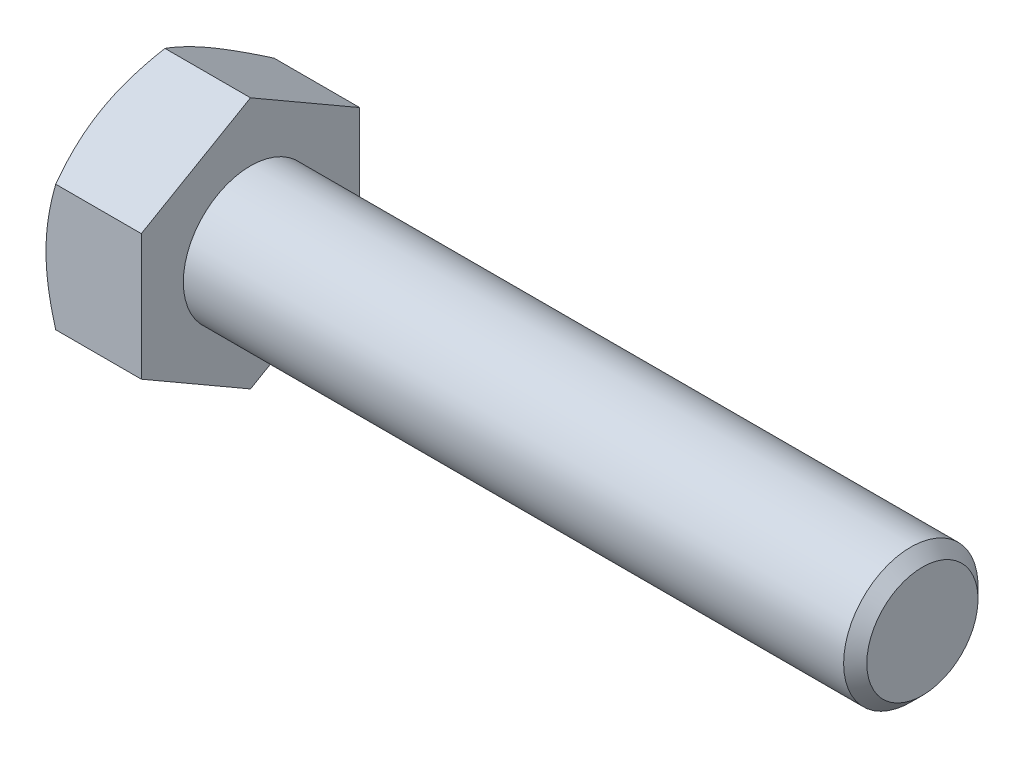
ISO-10303-21;
HEADER;
FILE_DESCRIPTION(('STEP AP214'),'2;1');
FILE_NAME('part.step','',(''),(''),'','','');
FILE_SCHEMA(('AUTOMOTIVE_DESIGN { 1 0 10303 214 1 1 1 1 }'));
ENDSEC;
DATA;
#1=APPLICATION_CONTEXT('core data for automotive mechanical design processes');
#2=APPLICATION_PROTOCOL_DEFINITION('international standard','automotive_design',2000,#1);
#3=PRODUCT_CONTEXT('',#1,'mechanical');
#4=PRODUCT('Part','Part','',(#3));
#5=PRODUCT_RELATED_PRODUCT_CATEGORY('part','',(#4));
#6=PRODUCT_DEFINITION_FORMATION('','',#4);
#7=PRODUCT_DEFINITION_CONTEXT('part definition',#1,'design');
#8=PRODUCT_DEFINITION('design','',#6,#7);
#9=PRODUCT_DEFINITION_SHAPE('','',#8);
#10=(LENGTH_UNIT() NAMED_UNIT(*) SI_UNIT(.MILLI.,.METRE.));
#11=(NAMED_UNIT(*) PLANE_ANGLE_UNIT() SI_UNIT($,.RADIAN.));
#12=(NAMED_UNIT(*) SI_UNIT($,.STERADIAN.) SOLID_ANGLE_UNIT());
#13=UNCERTAINTY_MEASURE_WITH_UNIT(LENGTH_MEASURE(1.E-05),#10,'distance_accuracy_value','');
#14=(GEOMETRIC_REPRESENTATION_CONTEXT(3) GLOBAL_UNCERTAINTY_ASSIGNED_CONTEXT((#13)) GLOBAL_UNIT_ASSIGNED_CONTEXT((#10,
#11,#12)) REPRESENTATION_CONTEXT('',''));
#15=CARTESIAN_POINT('',(0.,0.,0.));
#16=DIRECTION('',(0.,0.,1.));
#17=DIRECTION('',(1.,0.,0.));
#18=AXIS2_PLACEMENT_3D('',#15,#16,#17);
#19=CARTESIAN_POINT('',(5.675,3.75277674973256,-6.5));
#20=DIRECTION('',(0.,-0.866025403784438,0.500000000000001));
#21=DIRECTION('',(0.,-0.500000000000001,-0.866025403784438));
#22=AXIS2_PLACEMENT_3D('',#19,#20,#21);
#23=PLANE('',#22);
#24=CARTESIAN_POINT('',(0.580623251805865,7.50566896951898,0.0002));
#25=CARTESIAN_POINT('',(0.533004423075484,7.4231786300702,-0.14267745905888));
#26=CARTESIAN_POINT('',(0.487546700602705,7.34038072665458,-0.286087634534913));
#27=CARTESIAN_POINT('',(0.401548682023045,7.17411251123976,-0.574072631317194));
#28=CARTESIAN_POINT('',(0.361010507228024,7.09064192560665,-0.718647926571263));
#29=CARTESIAN_POINT('',(0.247571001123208,6.83889369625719,-1.15468865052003));
#30=CARTESIAN_POINT('',(0.183047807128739,6.66962231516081,-1.44787528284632));
#31=CARTESIAN_POINT('',(0.107386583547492,6.41631077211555,-1.88662374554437));
#32=CARTESIAN_POINT('',(0.0858328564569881,6.33302748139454,-2.03087463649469));
#33=CARTESIAN_POINT('',(0.0496903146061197,6.16608458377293,-2.32002821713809));
#34=CARTESIAN_POINT('',(0.0351008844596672,6.08242501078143,-2.46493084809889));
#35=CARTESIAN_POINT('',(0.0132587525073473,5.91496056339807,-2.75498777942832));
#36=CARTESIAN_POINT('',(0.00599772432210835,5.8311559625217,-2.90014160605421));
#37=CARTESIAN_POINT('',(-0.00103969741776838,5.66347396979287,-3.19057533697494));
#38=CARTESIAN_POINT('',(-0.000816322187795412,5.5795965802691,-3.33585523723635));
#39=CARTESIAN_POINT('',(0.0100834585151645,5.34979921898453,-3.73387594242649));
#40=CARTESIAN_POINT('',(0.0283818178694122,5.20395446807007,-3.98648646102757));
#41=CARTESIAN_POINT('',(0.0864063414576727,4.91323365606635,-4.49002967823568));
#42=CARTESIAN_POINT('',(0.126152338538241,4.76835861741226,-4.74096060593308));
#43=CARTESIAN_POINT('',(0.225505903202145,4.47705272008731,-5.24551722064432));
#44=CARTESIAN_POINT('',(0.285534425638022,4.33065861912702,-5.49907924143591));
#45=CARTESIAN_POINT('',(0.421774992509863,4.04005357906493,-6.00242193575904));
#46=CARTESIAN_POINT('',(0.497955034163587,3.89583891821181,-6.25220905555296));
#47=CARTESIAN_POINT('',(0.58062325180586,3.75266127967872,-6.5002));
#48=B_SPLINE_CURVE_WITH_KNOTS('',3,(#24,#25,#26,#27,#28,#29,#30,#31,#32,#33,#34,#35,#36,#37,#38,
#39,#40,#41,#42,#43,#44,#45,#46,#47),.UNSPECIFIED.,.F.,.F.,(4,2,2,2,2,2,2,2,2,2,2,4),(0.,
0.515105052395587,1.03043143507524,2.06322554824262,2.56697389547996,3.07067772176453,
3.57380860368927,4.0769239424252,4.9527935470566,5.82947446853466,6.72559912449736,
7.61996451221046),.UNSPECIFIED.);
#49=CARTESIAN_POINT('',(0.580556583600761,7.50555349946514,0.));
#50=VERTEX_POINT('',#49);
#51=CARTESIAN_POINT('',(0.,5.62916512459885,-3.25000000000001));
#52=VERTEX_POINT('',#51);
#53=EDGE_CURVE('E46',#50,#52,#48,.T.);
#54=ORIENTED_EDGE('',*,*,#53,.F.);
#55=DIRECTION('',(-1.,0.,0.));
#56=VECTOR('',#55,1.);
#57=CARTESIAN_POINT('',(5.675,7.50555349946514,0.));
#58=LINE('',#57,#56);
#59=CARTESIAN_POINT('',(5.675,7.50555349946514,0.));
#60=VERTEX_POINT('',#59);
#61=EDGE_CURVE('E142',#60,#50,#58,.T.);
#62=ORIENTED_EDGE('',*,*,#61,.F.);
#63=DIRECTION('',(0.,0.500000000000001,0.866025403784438));
#64=VECTOR('',#63,1.);
#65=CARTESIAN_POINT('',(5.675,3.75277674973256,-6.5));
#66=LINE('',#65,#64);
#67=CARTESIAN_POINT('',(5.675,3.75277674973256,-6.5));
#68=VERTEX_POINT('',#67);
#69=EDGE_CURVE('E227',#68,#60,#66,.T.);
#70=ORIENTED_EDGE('',*,*,#69,.F.);
#71=DIRECTION('',(-1.,0.,0.));
#72=VECTOR('',#71,1.);
#73=CARTESIAN_POINT('',(5.675,3.75277674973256,-6.5));
#74=LINE('',#73,#72);
#75=CARTESIAN_POINT('',(0.580556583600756,3.75277674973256,-6.5));
#76=VERTEX_POINT('',#75);
#77=EDGE_CURVE('E130',#68,#76,#74,.T.);
#78=ORIENTED_EDGE('',*,*,#77,.T.);
#79=EDGE_CURVE('E124',#52,#76,#48,.T.);
#80=ORIENTED_EDGE('',*,*,#79,.F.);
#81=EDGE_LOOP('',(#54,#62,#70,#78,#80));
#82=FACE_BOUND('',#81,.T.);
#83=ADVANCED_FACE('F30',(#82),#23,.F.);
#84=CARTESIAN_POINT('',(5.675,7.50555349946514,0.));
#85=DIRECTION('',(0.,-0.866025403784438,-0.500000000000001));
#86=DIRECTION('',(0.,0.500000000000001,-0.866025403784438));
#87=AXIS2_PLACEMENT_3D('',#84,#85,#86);
#88=PLANE('',#87);
#89=CARTESIAN_POINT('',(0.580623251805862,3.75266127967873,6.5002));
#90=CARTESIAN_POINT('',(0.53300442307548,3.8351516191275,6.35732254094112));
#91=CARTESIAN_POINT('',(0.487546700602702,3.91794952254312,6.21391236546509));
#92=CARTESIAN_POINT('',(0.401548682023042,4.08421773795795,5.9259273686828));
#93=CARTESIAN_POINT('',(0.361010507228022,4.16768832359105,5.78135207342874));
#94=CARTESIAN_POINT('',(0.247571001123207,4.41943655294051,5.34531134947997));
#95=CARTESIAN_POINT('',(0.183047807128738,4.58870793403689,5.05212471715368));
#96=CARTESIAN_POINT('',(0.107386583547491,4.84201947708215,4.61337625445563));
#97=CARTESIAN_POINT('',(0.0858328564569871,4.92530276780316,4.46912536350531));
#98=CARTESIAN_POINT('',(0.0496903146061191,5.09224566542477,4.17997178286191));
#99=CARTESIAN_POINT('',(0.0351008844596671,5.17590523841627,4.03506915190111));
#100=CARTESIAN_POINT('',(0.0132587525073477,5.34336968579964,3.74501222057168));
#101=CARTESIAN_POINT('',(0.00599772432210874,5.427174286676,3.59985839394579));
#102=CARTESIAN_POINT('',(-0.00103969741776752,5.59485627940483,3.30942466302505));
#103=CARTESIAN_POINT('',(-0.000816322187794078,5.6787336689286,3.16414476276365));
#104=CARTESIAN_POINT('',(0.0100834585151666,5.90853103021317,2.76612405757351));
#105=CARTESIAN_POINT('',(0.0283818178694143,6.05437578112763,2.51351353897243));
#106=CARTESIAN_POINT('',(0.0864063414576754,6.34509659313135,2.00997032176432));
#107=CARTESIAN_POINT('',(0.126152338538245,6.48997163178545,1.75903939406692));
#108=CARTESIAN_POINT('',(0.225505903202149,6.78127752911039,1.25448277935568));
#109=CARTESIAN_POINT('',(0.285534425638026,6.92767163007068,1.00092075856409));
#110=CARTESIAN_POINT('',(0.421774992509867,7.21827667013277,0.497578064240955));
#111=CARTESIAN_POINT('',(0.497955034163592,7.36249133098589,0.247790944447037));
#112=CARTESIAN_POINT('',(0.580623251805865,7.50566896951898,-0.000200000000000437));
#113=B_SPLINE_CURVE_WITH_KNOTS('',3,(#89,#90,#91,#92,#93,#94,#95,#96,#97,#98,#99,#100,#101,#102,
#103,#104,#105,#106,#107,#108,#109,#110,#111,#112),.UNSPECIFIED.,.F.,.F.,(4,2,2,2,2,2,2,2,2,2,2,
4),(0.,0.515105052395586,1.03043143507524,2.06322554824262,2.56697389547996,3.07067772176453,
3.57380860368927,4.07692394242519,4.9527935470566,5.82947446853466,6.72559912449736,
7.61996451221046),.UNSPECIFIED.);
#114=CARTESIAN_POINT('',(0.580556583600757,3.75277674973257,6.5));
#115=VERTEX_POINT('',#114);
#116=CARTESIAN_POINT('',(0.,5.62916512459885,3.25));
#117=VERTEX_POINT('',#116);
#118=EDGE_CURVE('E53',#115,#117,#113,.T.);
#119=ORIENTED_EDGE('',*,*,#118,.F.);
#120=DIRECTION('',(-1.,0.,0.));
#121=VECTOR('',#120,1.);
#122=CARTESIAN_POINT('',(5.675,3.75277674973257,6.5));
#123=LINE('',#122,#121);
#124=CARTESIAN_POINT('',(5.675,3.75277674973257,6.5));
#125=VERTEX_POINT('',#124);
#126=EDGE_CURVE('E140',#125,#115,#123,.T.);
#127=ORIENTED_EDGE('',*,*,#126,.F.);
#128=DIRECTION('',(0.,-0.500000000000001,0.866025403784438));
#129=VECTOR('',#128,1.);
#130=CARTESIAN_POINT('',(5.675,7.50555349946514,0.));
#131=LINE('',#130,#129);
#132=EDGE_CURVE('E225',#60,#125,#131,.T.);
#133=ORIENTED_EDGE('',*,*,#132,.F.);
#134=ORIENTED_EDGE('',*,*,#61,.T.);
#135=EDGE_CURVE('E157',#117,#50,#113,.T.);
#136=ORIENTED_EDGE('',*,*,#135,.F.);
#137=EDGE_LOOP('',(#119,#127,#133,#134,#136));
#138=FACE_BOUND('',#137,.T.);
#139=ADVANCED_FACE('F163',(#138),#88,.F.);
#140=CARTESIAN_POINT('',(5.675,3.75277674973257,6.5));
#141=DIRECTION('',(0.,0.,-1.));
#142=DIRECTION('',(0.,1.,0.));
#143=AXIS2_PLACEMENT_3D('',#140,#141,#142);
#144=PLANE('',#143);
#145=CARTESIAN_POINT('',(3.18835311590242,-10.1137456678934,6.5));
#146=CARTESIAN_POINT('',(3.05034774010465,-9.82952666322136,6.5));
#147=CARTESIAN_POINT('',(2.91365616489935,-9.54465869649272,6.5));
#148=CARTESIAN_POINT('',(2.64363899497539,-8.9732797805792,6.5));
#149=CARTESIAN_POINT('',(2.51031392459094,-8.6867685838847,6.5));
#150=CARTESIAN_POINT('',(2.24710473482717,-8.11029837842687,6.5));
#151=CARTESIAN_POINT('',(2.11724300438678,-7.8203291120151,6.5));
#152=CARTESIAN_POINT('',(1.86279082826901,-7.23809541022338,6.5));
#153=CARTESIAN_POINT('',(1.73820013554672,-6.94583108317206,6.5));
#154=CARTESIAN_POINT('',(1.4917668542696,-6.34906440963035,6.5));
#155=CARTESIAN_POINT('',(1.37014257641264,-6.04447142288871,6.5));
#156=CARTESIAN_POINT('',(1.13601865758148,-5.43173420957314,6.5));
#157=CARTESIAN_POINT('',(1.02352003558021,-5.12358959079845,6.5));
#158=CARTESIAN_POINT('',(0.810575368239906,-4.50382569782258,6.5));
#159=CARTESIAN_POINT('',(0.710105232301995,-4.19221478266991,6.5));
#160=CARTESIAN_POINT('',(0.524420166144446,-3.56452019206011,6.5));
#161=CARTESIAN_POINT('',(0.439200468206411,-3.24843794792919,6.5));
#162=CARTESIAN_POINT('',(0.288524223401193,-2.61335465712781,6.5));
#163=CARTESIAN_POINT('',(0.222961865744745,-2.29437912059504,6.5));
#164=CARTESIAN_POINT('',(0.115312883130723,-1.65238219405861,6.5));
#165=CARTESIAN_POINT('',(0.0732239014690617,-1.32936121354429,6.5));
#166=CARTESIAN_POINT('',(0.0304887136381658,-0.845231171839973,6.5));
#167=CARTESIAN_POINT('',(0.0196493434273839,-0.684982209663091,6.5));
#168=CARTESIAN_POINT('',(0.00475298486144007,-0.36416234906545,6.5));
#169=CARTESIAN_POINT('',(0.000695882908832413,-0.20359145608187,6.5));
#170=CARTESIAN_POINT('',(-0.00053159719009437,0.117577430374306,6.5));
#171=CARTESIAN_POINT('',(0.00229809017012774,0.278175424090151,6.5));
#172=CARTESIAN_POINT('',(0.014772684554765,0.599108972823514,6.5));
#173=CARTESIAN_POINT('',(0.0244179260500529,0.759444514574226,6.5));
#174=CARTESIAN_POINT('',(0.0554961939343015,1.14369946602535,6.5));
#175=CARTESIAN_POINT('',(0.0801030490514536,1.36736763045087,6.5));
#176=CARTESIAN_POINT('',(0.14124653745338,1.81305591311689,6.5));
#177=CARTESIAN_POINT('',(0.177784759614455,2.03507580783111,6.5));
#178=CARTESIAN_POINT('',(0.303360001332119,2.69839633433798,6.5));
#179=CARTESIAN_POINT('',(0.4083358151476,3.1367201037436,6.5));
#180=CARTESIAN_POINT('',(0.590564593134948,3.79232112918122,6.5));
#181=CARTESIAN_POINT('',(0.6563131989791,4.01299150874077,6.5));
#182=CARTESIAN_POINT('',(0.794681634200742,4.45218859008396,6.5));
#183=CARTESIAN_POINT('',(0.867301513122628,4.67071527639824,6.5));
#184=CARTESIAN_POINT('',(1.01824353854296,5.10569490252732,6.5));
#185=CARTESIAN_POINT('',(1.0965638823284,5.32214847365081,6.5));
#186=CARTESIAN_POINT('',(1.25798086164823,5.75325725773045,6.5));
#187=CARTESIAN_POINT('',(1.34107741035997,5.96791250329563,6.5));
#188=CARTESIAN_POINT('',(1.56029019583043,6.51888445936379,6.5));
#189=CARTESIAN_POINT('',(1.69936356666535,6.85402316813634,6.5));
#190=CARTESIAN_POINT('',(1.98501958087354,7.521095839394,6.5));
#191=CARTESIAN_POINT('',(2.13160288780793,7.85302951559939,6.5));
#192=CARTESIAN_POINT('',(2.43059748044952,8.51437865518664,6.5));
#193=CARTESIAN_POINT('',(2.5830105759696,8.843793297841,6.5));
#194=CARTESIAN_POINT('',(2.89234869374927,9.50047798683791,6.5));
#195=CARTESIAN_POINT('',(3.04927357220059,9.82774810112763,6.5));
#196=CARTESIAN_POINT('',(3.36692013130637,10.4809971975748,6.5));
#197=CARTESIAN_POINT('',(3.52764676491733,10.8069737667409,6.5));
#198=CARTESIAN_POINT('',(3.85198555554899,11.4574882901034,6.5));
#199=CARTESIAN_POINT('',(4.01559773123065,11.7820262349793,6.5));
#200=CARTESIAN_POINT('',(4.50986185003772,12.7537468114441,6.5));
#201=CARTESIAN_POINT('',(4.8439999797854,13.3991555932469,6.5));
#202=CARTESIAN_POINT('',(5.48575990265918,14.6239779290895,6.5));
#203=CARTESIAN_POINT('',(5.79279643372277,15.2036995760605,6.5));
#204=CARTESIAN_POINT('',(6.41069188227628,16.3611382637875,6.5));
#205=CARTESIAN_POINT('',(6.72155099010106,16.9388552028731,6.5));
#206=CARTESIAN_POINT('',(7.34519775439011,18.0910273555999,6.5));
#207=CARTESIAN_POINT('',(7.65797694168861,18.6654871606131,6.5));
#208=CARTESIAN_POINT('',(8.28574397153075,19.8131486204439,6.5));
#209=CARTESIAN_POINT('',(8.60073166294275,20.3863503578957,6.5));
#210=CARTESIAN_POINT('',(8.91652967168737,20.9591024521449,6.5));
#211=B_SPLINE_CURVE_WITH_KNOTS('',3,(#145,#146,#147,#148,#149,#150,#151,#152,#153,#154,#155,
#156,#157,#158,#159,#160,#161,#162,#163,#164,#165,#166,#167,#168,#169,#170,#171,#172,#173,#174,
#175,#176,#177,#178,#179,#180,#181,#182,#183,#184,#185,#186,#187,#188,#189,#190,#191,#192,#193,
#194,#195,#196,#197,#198,#199,#200,#201,#202,#203,#204,#205,#206,#207,#208,#209,#210),
.UNSPECIFIED.,.F.,.F.,(4,2,2,2,2,2,2,2,2,2,2,2,2,2,2,2,2,2,2,2,2,2,2,2,2,2,2,2,2,2,2,2,4),(0.,
0.94786866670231,1.89588406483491,2.84900320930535,3.80207763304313,4.78589774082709,
5.76982755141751,6.75175256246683,7.73337005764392,8.7096047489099,9.68574140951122,
10.1674651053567,10.6491807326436,11.1309009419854,11.6126447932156,12.287317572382,
12.9620802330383,14.312318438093,15.0030310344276,15.6937486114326,16.3842486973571,
17.0747362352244,18.1631508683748,19.2516618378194,20.3405135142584,21.429330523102,
22.5196540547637,23.6099846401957,25.7902468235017,27.7582608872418,29.7263733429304,
31.6886408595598,33.6507753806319),.UNSPECIFIED.);
#212=CARTESIAN_POINT('',(0.580556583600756,-3.75277674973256,6.5));
#213=VERTEX_POINT('',#212);
#214=CARTESIAN_POINT('',(0.,0.,6.5));
#215=VERTEX_POINT('',#214);
#216=EDGE_CURVE('E237',#213,#215,#211,.T.);
#217=ORIENTED_EDGE('',*,*,#216,.F.);
#218=DIRECTION('',(-1.,0.,0.));
#219=VECTOR('',#218,1.);
#220=CARTESIAN_POINT('',(5.675,-3.75277674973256,6.5));
#221=LINE('',#220,#219);
#222=CARTESIAN_POINT('',(5.675,-3.75277674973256,6.5));
#223=VERTEX_POINT('',#222);
#224=EDGE_CURVE('E132',#223,#213,#221,.T.);
#225=ORIENTED_EDGE('',*,*,#224,.F.);
#226=DIRECTION('',(0.,-1.,0.));
#227=VECTOR('',#226,1.);
#228=CARTESIAN_POINT('',(5.675,3.75277674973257,6.5));
#229=LINE('',#228,#227);
#230=EDGE_CURVE('E221',#125,#223,#229,.T.);
#231=ORIENTED_EDGE('',*,*,#230,.F.);
#232=ORIENTED_EDGE('',*,*,#126,.T.);
#233=EDGE_CURVE('E179',#215,#115,#211,.T.);
#234=ORIENTED_EDGE('',*,*,#233,.F.);
#235=EDGE_LOOP('',(#217,#225,#231,#232,#234));
#236=FACE_BOUND('',#235,.T.);
#237=ADVANCED_FACE('F243',(#236),#144,.F.);
#238=CARTESIAN_POINT('',(5.675,-7.50555349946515,0.));
#239=DIRECTION('',(0.,0.866025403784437,-0.500000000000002));
#240=DIRECTION('',(0.,0.500000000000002,0.866025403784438));
#241=AXIS2_PLACEMENT_3D('',#238,#239,#240);
#242=PLANE('',#241);
#243=CARTESIAN_POINT('',(0.580623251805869,-7.50566896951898,-0.000200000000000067));
#244=CARTESIAN_POINT('',(0.533004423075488,-7.42317863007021,0.14267745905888));
#245=CARTESIAN_POINT('',(0.487546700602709,-7.34038072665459,0.286087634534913));
#246=CARTESIAN_POINT('',(0.401548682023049,-7.17411251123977,0.574072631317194));
#247=CARTESIAN_POINT('',(0.361010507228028,-7.09064192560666,0.718647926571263));
#248=CARTESIAN_POINT('',(0.247571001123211,-6.8388936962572,1.15468865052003));
#249=CARTESIAN_POINT('',(0.183047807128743,-6.66962231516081,1.44787528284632));
#250=CARTESIAN_POINT('',(0.107386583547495,-6.41631077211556,1.88662374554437));
#251=CARTESIAN_POINT('',(0.0858328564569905,-6.33302748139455,2.03087463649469));
#252=CARTESIAN_POINT('',(0.049690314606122,-6.16608458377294,2.32002821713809));
#253=CARTESIAN_POINT('',(0.0351008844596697,-6.08242501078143,2.46493084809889));
#254=CARTESIAN_POINT('',(0.0132587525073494,-5.91496056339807,2.75498777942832));
#255=CARTESIAN_POINT('',(0.00599772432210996,-5.83115596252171,2.90014160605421));
#256=CARTESIAN_POINT('',(-0.00103969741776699,-5.66347396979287,3.19057533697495));
#257=CARTESIAN_POINT('',(-0.000816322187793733,-5.5795965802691,3.33585523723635));
#258=CARTESIAN_POINT('',(0.0100834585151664,-5.34979921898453,3.73387594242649));
#259=CARTESIAN_POINT('',(0.0283818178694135,-5.20395446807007,3.98648646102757));
#260=CARTESIAN_POINT('',(0.0864063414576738,-4.91323365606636,4.49002967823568));
#261=CARTESIAN_POINT('',(0.126152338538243,-4.76835861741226,4.74096060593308));
#262=CARTESIAN_POINT('',(0.225505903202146,-4.47705272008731,5.24551722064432));
#263=CARTESIAN_POINT('',(0.285534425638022,-4.33065861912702,5.49907924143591));
#264=CARTESIAN_POINT('',(0.421774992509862,-4.04005357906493,6.00242193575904));
#265=CARTESIAN_POINT('',(0.497955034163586,-3.89583891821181,6.25220905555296));
#266=CARTESIAN_POINT('',(0.580623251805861,-3.75266127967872,6.5002));
#267=B_SPLINE_CURVE_WITH_KNOTS('',3,(#243,#244,#245,#246,#247,#248,#249,#250,#251,#252,#253,
#254,#255,#256,#257,#258,#259,#260,#261,#262,#263,#264,#265,#266),.UNSPECIFIED.,.F.,.F.,(4,2,2,
2,2,2,2,2,2,2,2,4),(0.,0.515105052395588,1.03043143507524,2.06322554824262,2.56697389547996,
3.07067772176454,3.57380860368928,4.0769239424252,4.9527935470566,5.82947446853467,
6.72559912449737,7.61996451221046),.UNSPECIFIED.);
#268=CARTESIAN_POINT('',(0.580556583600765,-7.50555349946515,0.));
#269=VERTEX_POINT('',#268);
#270=CARTESIAN_POINT('',(0.,-5.62916512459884,3.25000000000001));
#271=VERTEX_POINT('',#270);
#272=EDGE_CURVE('E165',#269,#271,#267,.T.);
#273=ORIENTED_EDGE('',*,*,#272,.F.);
#274=DIRECTION('',(-1.,0.,0.));
#275=VECTOR('',#274,1.);
#276=CARTESIAN_POINT('',(5.675,-7.50555349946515,0.));
#277=LINE('',#276,#275);
#278=CARTESIAN_POINT('',(5.675,-7.50555349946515,0.));
#279=VERTEX_POINT('',#278);
#280=EDGE_CURVE('E129',#279,#269,#277,.T.);
#281=ORIENTED_EDGE('',*,*,#280,.F.);
#282=DIRECTION('',(0.,-0.500000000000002,-0.866025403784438));
#283=VECTOR('',#282,1.);
#284=CARTESIAN_POINT('',(5.675,-7.50555349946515,0.));
#285=LINE('',#284,#283);
#286=EDGE_CURVE('E219',#223,#279,#285,.T.);
#287=ORIENTED_EDGE('',*,*,#286,.F.);
#288=ORIENTED_EDGE('',*,*,#224,.T.);
#289=EDGE_CURVE('E167',#271,#213,#267,.T.);
#290=ORIENTED_EDGE('',*,*,#289,.F.);
#291=EDGE_LOOP('',(#273,#281,#287,#288,#290));
#292=FACE_BOUND('',#291,.T.);
#293=ADVANCED_FACE('F215',(#292),#242,.F.);
#294=CARTESIAN_POINT('',(5.675,-3.75277674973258,-6.5));
#295=DIRECTION('',(0.,0.866025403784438,0.5));
#296=DIRECTION('',(0.,-0.5,0.866025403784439));
#297=AXIS2_PLACEMENT_3D('',#294,#295,#296);
#298=PLANE('',#297);
#299=CARTESIAN_POINT('',(0.580623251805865,-3.75266127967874,-6.5002));
#300=CARTESIAN_POINT('',(0.533004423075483,-3.83515161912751,-6.35732254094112));
#301=CARTESIAN_POINT('',(0.487546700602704,-3.91794952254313,-6.21391236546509));
#302=CARTESIAN_POINT('',(0.401548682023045,-4.08421773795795,-5.9259273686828));
#303=CARTESIAN_POINT('',(0.361010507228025,-4.16768832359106,-5.78135207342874));
#304=CARTESIAN_POINT('',(0.24757100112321,-4.41943655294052,-5.34531134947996));
#305=CARTESIAN_POINT('',(0.183047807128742,-4.5887079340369,-5.05212471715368));
#306=CARTESIAN_POINT('',(0.107386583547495,-4.84201947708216,-4.61337625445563));
#307=CARTESIAN_POINT('',(0.085832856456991,-4.92530276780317,-4.46912536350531));
#308=CARTESIAN_POINT('',(0.0496903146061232,-5.09224566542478,-4.17997178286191));
#309=CARTESIAN_POINT('',(0.0351008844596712,-5.17590523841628,-4.03506915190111));
#310=CARTESIAN_POINT('',(0.0132587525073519,-5.34336968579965,-3.74501222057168));
#311=CARTESIAN_POINT('',(0.00599772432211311,-5.42717428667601,-3.59985839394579));
#312=CARTESIAN_POINT('',(-0.00103969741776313,-5.59485627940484,-3.30942466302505));
#313=CARTESIAN_POINT('',(-0.000816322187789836,-5.67873366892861,-3.16414476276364));
#314=CARTESIAN_POINT('',(0.0100834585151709,-5.90853103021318,-2.76612405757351));
#315=CARTESIAN_POINT('',(0.028381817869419,-6.05437578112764,-2.51351353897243));
#316=CARTESIAN_POINT('',(0.0864063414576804,-6.34509659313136,-2.00997032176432));
#317=CARTESIAN_POINT('',(0.12615233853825,-6.48997163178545,-1.75903939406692));
#318=CARTESIAN_POINT('',(0.225505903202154,-6.78127752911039,-1.25448277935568));
#319=CARTESIAN_POINT('',(0.28553442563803,-6.92767163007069,-1.00092075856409));
#320=CARTESIAN_POINT('',(0.421774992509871,-7.21827667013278,-0.497578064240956));
#321=CARTESIAN_POINT('',(0.497955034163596,-7.3624913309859,-0.247790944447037));
#322=CARTESIAN_POINT('',(0.580623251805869,-7.50566896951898,0.000199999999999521));
#323=B_SPLINE_CURVE_WITH_KNOTS('',3,(#299,#300,#301,#302,#303,#304,#305,#306,#307,#308,#309,
#310,#311,#312,#313,#314,#315,#316,#317,#318,#319,#320,#321,#322),.UNSPECIFIED.,.F.,.F.,(4,2,2,
2,2,2,2,2,2,2,2,4),(0.,0.515105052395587,1.03043143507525,2.06322554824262,2.56697389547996,
3.07067772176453,3.57380860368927,4.0769239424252,4.9527935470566,5.82947446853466,
6.72559912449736,7.61996451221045),.UNSPECIFIED.);
#324=CARTESIAN_POINT('',(0.580556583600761,-3.75277674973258,-6.5));
#325=VERTEX_POINT('',#324);
#326=CARTESIAN_POINT('',(0.,-5.62916512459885,-3.25));
#327=VERTEX_POINT('',#326);
#328=EDGE_CURVE('E106',#325,#327,#323,.T.);
#329=ORIENTED_EDGE('',*,*,#328,.F.);
#330=DIRECTION('',(-1.,0.,0.));
#331=VECTOR('',#330,1.);
#332=CARTESIAN_POINT('',(5.675,-3.75277674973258,-6.5));
#333=LINE('',#332,#331);
#334=CARTESIAN_POINT('',(5.675,-3.75277674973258,-6.5));
#335=VERTEX_POINT('',#334);
#336=EDGE_CURVE('E120',#335,#325,#333,.T.);
#337=ORIENTED_EDGE('',*,*,#336,.F.);
#338=DIRECTION('',(0.,0.5,-0.866025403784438));
#339=VECTOR('',#338,1.);
#340=CARTESIAN_POINT('',(5.675,-3.75277674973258,-6.5));
#341=LINE('',#340,#339);
#342=EDGE_CURVE('E217',#279,#335,#341,.T.);
#343=ORIENTED_EDGE('',*,*,#342,.F.);
#344=ORIENTED_EDGE('',*,*,#280,.T.);
#345=EDGE_CURVE('E123',#327,#269,#323,.T.);
#346=ORIENTED_EDGE('',*,*,#345,.F.);
#347=EDGE_LOOP('',(#329,#337,#343,#344,#346));
#348=FACE_BOUND('',#347,.T.);
#349=ADVANCED_FACE('F118',(#348),#298,.F.);
#350=CARTESIAN_POINT('',(5.675,3.75277674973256,-6.5));
#351=DIRECTION('',(0.,0.,1.));
#352=DIRECTION('',(0.,-1.,0.));
#353=AXIS2_PLACEMENT_3D('',#350,#351,#352);
#354=PLANE('',#353);
#355=CARTESIAN_POINT('',(3.18835311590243,-10.1137456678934,-6.5));
#356=CARTESIAN_POINT('',(3.05034774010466,-9.82952666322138,-6.5));
#357=CARTESIAN_POINT('',(2.91365616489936,-9.54465869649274,-6.5));
#358=CARTESIAN_POINT('',(2.64363899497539,-8.97327978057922,-6.5));
#359=CARTESIAN_POINT('',(2.51031392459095,-8.68676858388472,-6.5));
#360=CARTESIAN_POINT('',(2.24710473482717,-8.11029837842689,-6.5));
#361=CARTESIAN_POINT('',(2.11724300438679,-7.82032911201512,-6.5));
#362=CARTESIAN_POINT('',(1.86279082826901,-7.2380954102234,-6.5));
#363=CARTESIAN_POINT('',(1.73820013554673,-6.94583108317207,-6.5));
#364=CARTESIAN_POINT('',(1.4917668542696,-6.34906440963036,-6.5));
#365=CARTESIAN_POINT('',(1.37014257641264,-6.04447142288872,-6.5));
#366=CARTESIAN_POINT('',(1.13601865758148,-5.43173420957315,-6.5));
#367=CARTESIAN_POINT('',(1.02352003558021,-5.12358959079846,-6.5));
#368=CARTESIAN_POINT('',(0.810575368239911,-4.5038256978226,-6.5));
#369=CARTESIAN_POINT('',(0.710105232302,-4.19221478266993,-6.5));
#370=CARTESIAN_POINT('',(0.52442016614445,-3.56452019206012,-6.5));
#371=CARTESIAN_POINT('',(0.439200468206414,-3.24843794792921,-6.5));
#372=CARTESIAN_POINT('',(0.288524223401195,-2.61335465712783,-6.5));
#373=CARTESIAN_POINT('',(0.222961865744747,-2.29437912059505,-6.5));
#374=CARTESIAN_POINT('',(0.115312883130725,-1.65238219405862,-6.5));
#375=CARTESIAN_POINT('',(0.0732239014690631,-1.3293612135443,-6.5));
#376=CARTESIAN_POINT('',(0.0304887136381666,-0.845231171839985,-6.5));
#377=CARTESIAN_POINT('',(0.0196493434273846,-0.684982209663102,-6.5));
#378=CARTESIAN_POINT('',(0.00475298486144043,-0.36416234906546,-6.5));
#379=CARTESIAN_POINT('',(0.000695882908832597,-0.20359145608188,-6.5));
#380=CARTESIAN_POINT('',(-0.000531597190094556,0.117577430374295,-6.5));
#381=CARTESIAN_POINT('',(0.00229809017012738,0.278175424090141,-6.5));
#382=CARTESIAN_POINT('',(0.0147726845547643,0.599108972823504,-6.5));
#383=CARTESIAN_POINT('',(0.0244179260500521,0.759444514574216,-6.5));
#384=CARTESIAN_POINT('',(0.0554961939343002,1.14369946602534,-6.5));
#385=CARTESIAN_POINT('',(0.0801030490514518,1.36736763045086,-6.5));
#386=CARTESIAN_POINT('',(0.141246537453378,1.81305591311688,-6.5));
#387=CARTESIAN_POINT('',(0.177784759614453,2.03507580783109,-6.5));
#388=CARTESIAN_POINT('',(0.303360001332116,2.69839633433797,-6.5));
#389=CARTESIAN_POINT('',(0.408335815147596,3.13672010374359,-6.5));
#390=CARTESIAN_POINT('',(0.590564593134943,3.79232112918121,-6.5));
#391=CARTESIAN_POINT('',(0.656313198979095,4.01299150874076,-6.5));
#392=CARTESIAN_POINT('',(0.794681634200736,4.45218859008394,-6.5));
#393=CARTESIAN_POINT('',(0.867301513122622,4.67071527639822,-6.5));
#394=CARTESIAN_POINT('',(1.01824353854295,5.1056949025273,-6.5));
#395=CARTESIAN_POINT('',(1.09656388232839,5.3221484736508,-6.5));
#396=CARTESIAN_POINT('',(1.25798086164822,5.75325725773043,-6.5));
#397=CARTESIAN_POINT('',(1.34107741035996,5.96791250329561,-6.5));
#398=CARTESIAN_POINT('',(1.56029019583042,6.51888445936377,-6.5));
#399=CARTESIAN_POINT('',(1.69936356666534,6.85402316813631,-6.5));
#400=CARTESIAN_POINT('',(1.98501958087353,7.52109583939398,-6.5));
#401=CARTESIAN_POINT('',(2.13160288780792,7.85302951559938,-6.5));
#402=CARTESIAN_POINT('',(2.43059748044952,8.51437865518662,-6.5));
#403=CARTESIAN_POINT('',(2.58301057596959,8.84379329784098,-6.5));
#404=CARTESIAN_POINT('',(2.89234869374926,9.50047798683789,-6.5));
#405=CARTESIAN_POINT('',(3.04927357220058,9.82774810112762,-6.5));
#406=CARTESIAN_POINT('',(3.36692013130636,10.4809971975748,-6.5));
#407=CARTESIAN_POINT('',(3.52764676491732,10.8069737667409,-6.5));
#408=CARTESIAN_POINT('',(3.85198555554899,11.4574882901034,-6.5));
#409=CARTESIAN_POINT('',(4.01559773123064,11.7820262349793,-6.5));
#410=CARTESIAN_POINT('',(4.50986185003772,12.7537468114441,-6.5));
#411=CARTESIAN_POINT('',(4.84399997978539,13.3991555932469,-6.5));
#412=CARTESIAN_POINT('',(5.48575990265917,14.6239779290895,-6.5));
#413=CARTESIAN_POINT('',(5.79279643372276,15.2036995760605,-6.5));
#414=CARTESIAN_POINT('',(6.41069188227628,16.3611382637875,-6.5));
#415=CARTESIAN_POINT('',(6.72155099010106,16.9388552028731,-6.5));
#416=CARTESIAN_POINT('',(7.34519775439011,18.0910273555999,-6.5));
#417=CARTESIAN_POINT('',(7.65797694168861,18.6654871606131,-6.5));
#418=CARTESIAN_POINT('',(8.28574397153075,19.8131486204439,-6.5));
#419=CARTESIAN_POINT('',(8.60073166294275,20.3863503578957,-6.5));
#420=CARTESIAN_POINT('',(8.91652967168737,20.9591024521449,-6.5));
#421=B_SPLINE_CURVE_WITH_KNOTS('',3,(#355,#356,#357,#358,#359,#360,#361,#362,#363,#364,#365,
#366,#367,#368,#369,#370,#371,#372,#373,#374,#375,#376,#377,#378,#379,#380,#381,#382,#383,#384,
#385,#386,#387,#388,#389,#390,#391,#392,#393,#394,#395,#396,#397,#398,#399,#400,#401,#402,#403,
#404,#405,#406,#407,#408,#409,#410,#411,#412,#413,#414,#415,#416,#417,#418,#419,#420),
.UNSPECIFIED.,.F.,.F.,(4,2,2,2,2,2,2,2,2,2,2,2,2,2,2,2,2,2,2,2,2,2,2,2,2,2,2,2,2,2,2,2,4),(0.,
0.947868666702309,1.89588406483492,2.84900320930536,3.80207763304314,4.7858977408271,
5.76982755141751,6.75175256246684,7.73337005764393,8.7096047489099,9.68574140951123,
10.1674651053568,10.6491807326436,11.1309009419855,11.6126447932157,12.287317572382,
12.9620802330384,14.312318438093,15.0030310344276,15.6937486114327,16.3842486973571,
17.0747362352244,18.1631508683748,19.2516618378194,20.3405135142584,21.429330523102,
22.5196540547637,23.6099846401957,25.7902468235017,27.7582608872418,29.7263733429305,
31.6886408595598,33.6507753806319),.UNSPECIFIED.);
#422=CARTESIAN_POINT('',(0.,0.,-6.5));
#423=VERTEX_POINT('',#422);
#424=EDGE_CURVE('E112',#76,#423,#421,.F.);
#425=ORIENTED_EDGE('',*,*,#424,.F.);
#426=ORIENTED_EDGE('',*,*,#77,.F.);
#427=DIRECTION('',(0.,1.,0.));
#428=VECTOR('',#427,1.);
#429=CARTESIAN_POINT('',(5.675,3.75277674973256,-6.5));
#430=LINE('',#429,#428);
#431=EDGE_CURVE('E128',#335,#68,#430,.T.);
#432=ORIENTED_EDGE('',*,*,#431,.F.);
#433=ORIENTED_EDGE('',*,*,#336,.T.);
#434=EDGE_CURVE('E103',#423,#325,#421,.F.);
#435=ORIENTED_EDGE('',*,*,#434,.F.);
#436=EDGE_LOOP('',(#425,#426,#432,#433,#435));
#437=FACE_BOUND('',#436,.T.);
#438=ADVANCED_FACE('F126',(#437),#354,.F.);
#439=CARTESIAN_POINT('',(5.675,7.50555349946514,0.));
#440=DIRECTION('',(1.,0.,0.));
#441=DIRECTION('',(0.,0.,-1.));
#442=AXIS2_PLACEMENT_3D('',#439,#440,#441);
#443=PLANE('',#442);
#444=ORIENTED_EDGE('',*,*,#69,.T.);
#445=ORIENTED_EDGE('',*,*,#132,.T.);
#446=ORIENTED_EDGE('',*,*,#230,.T.);
#447=ORIENTED_EDGE('',*,*,#286,.T.);
#448=ORIENTED_EDGE('',*,*,#342,.T.);
#449=ORIENTED_EDGE('',*,*,#431,.T.);
#450=EDGE_LOOP('',(#444,#445,#446,#447,#448,#449));
#451=FACE_BOUND('',#450,.T.);
#452=CARTESIAN_POINT('',(5.675,0.,0.));
#453=DIRECTION('',(1.,0.,0.));
#454=DIRECTION('',(0.,0.,-1.));
#455=AXIS2_PLACEMENT_3D('',#452,#453,#454);
#456=CIRCLE('',#455,4.);
#457=CARTESIAN_POINT('',(5.675,0.,-4.));
#458=VERTEX_POINT('',#457);
#459=EDGE_CURVE('E230',#458,#458,#456,.F.);
#460=ORIENTED_EDGE('',*,*,#459,.T.);
#461=EDGE_LOOP('',(#460));
#462=FACE_BOUND('',#461,.T.);
#463=ADVANCED_FACE('F245',(#451,#462),#443,.T.);
#464=CARTESIAN_POINT('',(0.,0.,0.));
#465=DIRECTION('',(-1.,0.,0.));
#466=DIRECTION('',(0.,0.,1.));
#467=AXIS2_PLACEMENT_3D('',#464,#465,#466);
#468=CYLINDRICAL_SURFACE('',#467,4.);
#469=ORIENTED_EDGE('',*,*,#459,.F.);
#470=EDGE_LOOP('',(#469));
#471=FACE_BOUND('',#470,.T.);
#472=CARTESIAN_POINT('',(44.9845000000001,0.,0.));
#473=DIRECTION('',(-1.,0.,0.));
#474=DIRECTION('',(0.,0.,1.));
#475=AXIS2_PLACEMENT_3D('',#472,#473,#474);
#476=CIRCLE('',#475,4.);
#477=CARTESIAN_POINT('',(44.9845000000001,0.,4.));
#478=VERTEX_POINT('',#477);
#479=EDGE_CURVE('E233',#478,#478,#476,.T.);
#480=ORIENTED_EDGE('',*,*,#479,.T.);
#481=EDGE_LOOP('',(#480));
#482=FACE_BOUND('',#481,.T.);
#483=ADVANCED_FACE('F277',(#471,#482),#468,.T.);
#484=CARTESIAN_POINT('',(45.675,0.,0.));
#485=DIRECTION('',(-1.,0.,0.));
#486=DIRECTION('',(0.,0.,1.));
#487=AXIS2_PLACEMENT_3D('',#484,#485,#486);
#488=CONICAL_SURFACE('',#487,3.3095,0.785398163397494);
#489=ORIENTED_EDGE('',*,*,#479,.F.);
#490=EDGE_LOOP('',(#489));
#491=FACE_BOUND('',#490,.T.);
#492=CARTESIAN_POINT('',(45.675,0.,0.));
#493=DIRECTION('',(-1.,0.,0.));
#494=DIRECTION('',(0.,0.,1.));
#495=AXIS2_PLACEMENT_3D('',#492,#493,#494);
#496=CIRCLE('',#495,3.3095);
#497=CARTESIAN_POINT('',(45.675,0.,3.3095));
#498=VERTEX_POINT('',#497);
#499=EDGE_CURVE('E235',#498,#498,#496,.T.);
#500=ORIENTED_EDGE('',*,*,#499,.T.);
#501=EDGE_LOOP('',(#500));
#502=FACE_BOUND('',#501,.T.);
#503=ADVANCED_FACE('F279',(#491,#502),#488,.T.);
#504=CARTESIAN_POINT('',(45.675,0.,0.));
#505=DIRECTION('',(-1.,0.,0.));
#506=DIRECTION('',(0.,0.,1.));
#507=AXIS2_PLACEMENT_3D('',#504,#505,#506);
#508=PLANE('',#507);
#509=ORIENTED_EDGE('',*,*,#499,.F.);
#510=EDGE_LOOP('',(#509));
#511=FACE_BOUND('',#510,.T.);
#512=ADVANCED_FACE('F192',(#511),#508,.F.);
#513=CARTESIAN_POINT('',(0.,0.,0.));
#514=DIRECTION('',(1.,0.,0.));
#515=DIRECTION('',(0.,0.,-1.));
#516=AXIS2_PLACEMENT_3D('',#513,#514,#515);
#517=CONICAL_SURFACE('',#516,6.5,1.0471975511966);
#518=ORIENTED_EDGE('',*,*,#328,.T.);
#519=CARTESIAN_POINT('',(0.,0.,0.));
#520=DIRECTION('',(1.,0.,0.));
#521=DIRECTION('',(0.,0.,-1.));
#522=AXIS2_PLACEMENT_3D('',#519,#520,#521);
#523=CIRCLE('',#522,6.5);
#524=EDGE_CURVE('E34',#327,#423,#523,.T.);
#525=ORIENTED_EDGE('',*,*,#524,.T.);
#526=ORIENTED_EDGE('',*,*,#434,.T.);
#527=EDGE_LOOP('',(#518,#525,#526));
#528=FACE_BOUND('',#527,.T.);
#529=ADVANCED_FACE('F105',(#528),#517,.T.);
#530=ORIENTED_EDGE('',*,*,#272,.T.);
#531=EDGE_CURVE('E147',#271,#327,#523,.T.);
#532=ORIENTED_EDGE('',*,*,#531,.T.);
#533=ORIENTED_EDGE('',*,*,#345,.T.);
#534=EDGE_LOOP('',(#530,#532,#533));
#535=FACE_BOUND('',#534,.T.);
#536=ADVANCED_FACE('F191',(#535),#517,.T.);
#537=ORIENTED_EDGE('',*,*,#216,.T.);
#538=EDGE_CURVE('E148',#215,#271,#523,.T.);
#539=ORIENTED_EDGE('',*,*,#538,.T.);
#540=ORIENTED_EDGE('',*,*,#289,.T.);
#541=EDGE_LOOP('',(#537,#539,#540));
#542=FACE_BOUND('',#541,.T.);
#543=ADVANCED_FACE('F186',(#542),#517,.T.);
#544=ORIENTED_EDGE('',*,*,#233,.T.);
#545=ORIENTED_EDGE('',*,*,#118,.T.);
#546=CARTESIAN_POINT('',(0.,0.,0.));
#547=DIRECTION('',(-1.,0.,0.));
#548=DIRECTION('',(0.,0.,1.));
#549=AXIS2_PLACEMENT_3D('',#546,#547,#548);
#550=CIRCLE('',#549,6.5);
#551=EDGE_CURVE('E113',#215,#117,#550,.T.);
#552=ORIENTED_EDGE('',*,*,#551,.F.);
#553=EDGE_LOOP('',(#544,#545,#552));
#554=FACE_BOUND('',#553,.T.);
#555=ADVANCED_FACE('F190',(#554),#517,.T.);
#556=ORIENTED_EDGE('',*,*,#135,.T.);
#557=ORIENTED_EDGE('',*,*,#53,.T.);
#558=EDGE_CURVE('E39',#52,#117,#523,.T.);
#559=ORIENTED_EDGE('',*,*,#558,.T.);
#560=EDGE_LOOP('',(#556,#557,#559));
#561=FACE_BOUND('',#560,.T.);
#562=ADVANCED_FACE('F156',(#561),#517,.T.);
#563=ORIENTED_EDGE('',*,*,#79,.T.);
#564=ORIENTED_EDGE('',*,*,#424,.T.);
#565=EDGE_CURVE('E11',#423,#52,#523,.T.);
#566=ORIENTED_EDGE('',*,*,#565,.T.);
#567=EDGE_LOOP('',(#563,#564,#566));
#568=FACE_BOUND('',#567,.T.);
#569=ADVANCED_FACE('F249',(#568),#517,.T.);
#570=CARTESIAN_POINT('',(0.,7.50555349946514,0.));
#571=DIRECTION('',(1.,0.,0.));
#572=DIRECTION('',(0.,0.,-1.));
#573=AXIS2_PLACEMENT_3D('',#570,#571,#572);
#574=PLANE('',#573);
#575=ORIENTED_EDGE('',*,*,#565,.F.);
#576=ORIENTED_EDGE('',*,*,#524,.F.);
#577=ORIENTED_EDGE('',*,*,#531,.F.);
#578=ORIENTED_EDGE('',*,*,#538,.F.);
#579=ORIENTED_EDGE('',*,*,#551,.T.);
#580=ORIENTED_EDGE('',*,*,#558,.F.);
#581=EDGE_LOOP('',(#575,#576,#577,#578,#579,#580));
#582=FACE_BOUND('',#581,.T.);
#583=ADVANCED_FACE('F160',(#582),#574,.F.);
#584=CLOSED_SHELL('',(#83,#139,#237,#293,#349,#438,#463,#483,#503,#512,#529,#536,#543,#555,#562,
#569,#583));
#585=MANIFOLD_SOLID_BREP('B2',#584);
#586=ADVANCED_BREP_SHAPE_REPRESENTATION('',(#18,#585),#14);
#587=SHAPE_DEFINITION_REPRESENTATION(#9,#586);
ENDSEC;
END-ISO-10303-21;
